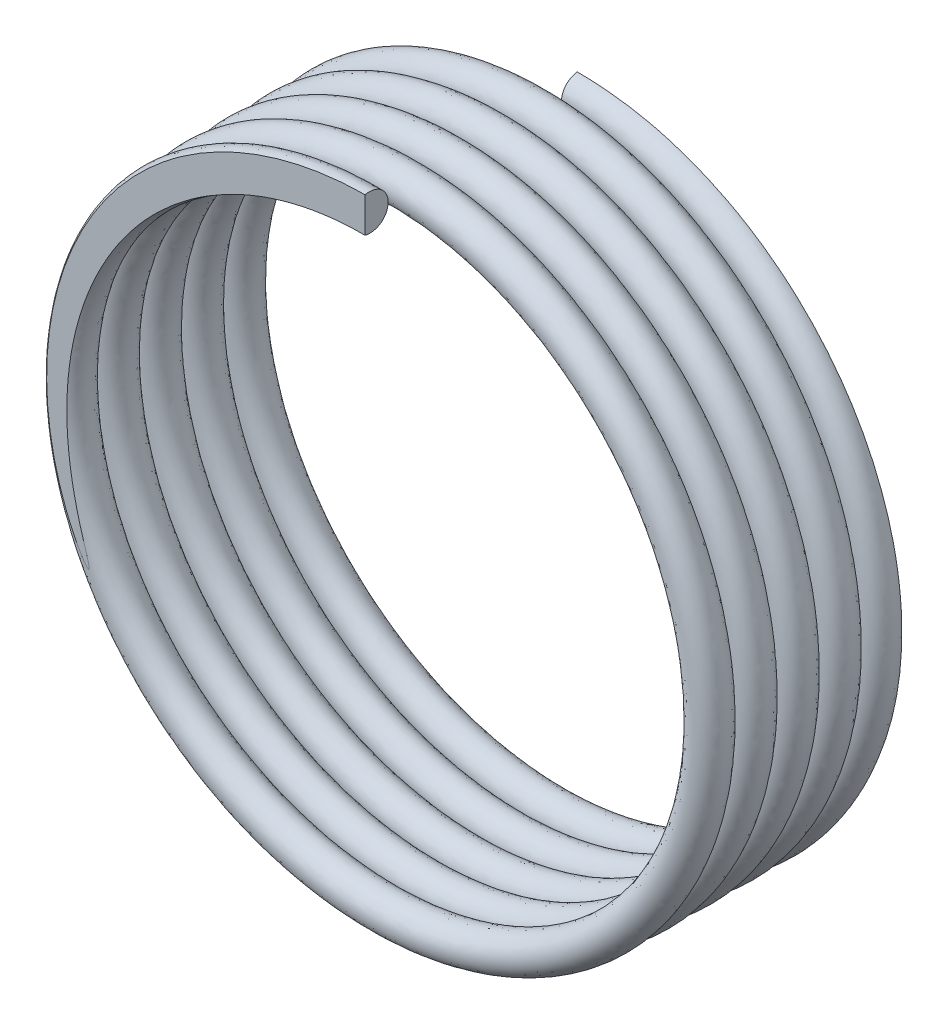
from build123d import *

# Parameters (mm, degrees)
AUSTRAGUNG1_PITCH                    = 1.16
AUSTRAGUNG1_HEIGHT                   = 5.8
AUSTRAGUNG1_RADIUS                   = 8.5
AUSTRAGUNG1_START_ANGLE              = 90
SKIZZE2_R                            = 0.5
SCHNITT_LINEAR_AUSTRAGEN1_DEPTH      = 15.201710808
SCHNITT_LINEAR_AUSTRAGEN1_DEPTH_BACK = 15.201710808
SKIZZE5_OUTSIDE_W                    = 14.07
SKIZZE5_OUTSIDE_H                    = 25.27
SKIZZE5_OUTSIDE_W_2                  = 5.85
SKIZZE5_OUTSIDE_H_2                  = 20.3212608


with BuildPart() as part:
    # Austragung1: sweep along a helix
    with BuildLine() as austragung1_path:
        add(Helix(AUSTRAGUNG1_PITCH, AUSTRAGUNG1_HEIGHT, AUSTRAGUNG1_RADIUS, center=(0, 0, 0), direction=(0, 0, 1), lefthand=True, mode=Mode.PRIVATE).rotate(Axis((0, 0, 0), (0, 0, 1)), AUSTRAGUNG1_START_ANGLE))
    # Skizze2 → Austragung1 (sweep)
    with BuildSketch(Plane(origin=(0, 8.5, 5.8), x_dir=(0.02171484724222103, -2.85416636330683e-15, -0.9997642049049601), z_dir=(0.9997642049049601, -6.74577072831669e-14, 0.02171484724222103))):
        Circle(SKIZZE2_R)
    sweep(path=austragung1_path.line, is_frenet=True)

    # Skizze5 outside → Schnitt-Linear austragen1 (cut, two sides: drawn at the far end of the back side and taken through both)
    with BuildSketch(Plane(origin=(0, 0, 0), x_dir=(0, 0, -1), z_dir=(1, 0, 0)).offset(-SCHNITT_LINEAR_AUSTRAGEN1_DEPTH_BACK)):
        with Locations((-2.9, 0)):
            Rectangle(SKIZZE5_OUTSIDE_W, SKIZZE5_OUTSIDE_H)
        with Locations((-3, 0)):
            Rectangle(SKIZZE5_OUTSIDE_W_2, SKIZZE5_OUTSIDE_H_2, mode=Mode.SUBTRACT)
    extrude(amount=SCHNITT_LINEAR_AUSTRAGEN1_DEPTH + SCHNITT_LINEAR_AUSTRAGEN1_DEPTH_BACK, mode=Mode.SUBTRACT)


solid = part.part
